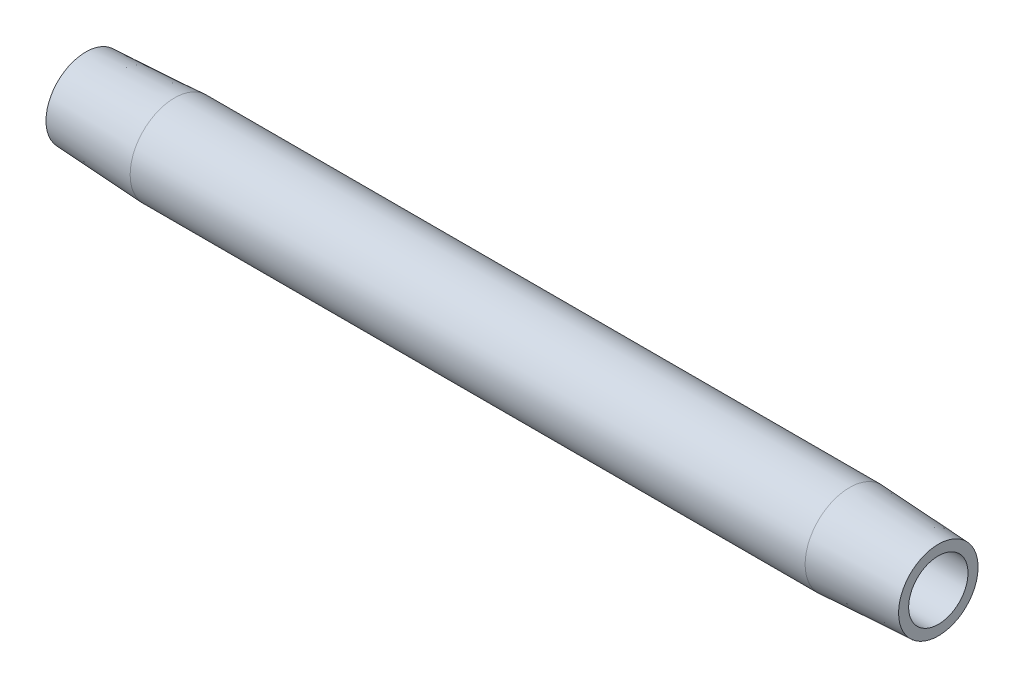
from build123d import *


with BuildPart() as part:
    # Sketch2 → Revolve1 (revolve)
    with BuildSketch(Plane.XY, mode=Mode.PRIVATE) as revolve1_sk:
        Polygon((7.9375, 3.96875), (0, 3.552763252), (0, 2.6543), (76.2, 2.6543), (76.2, 3.552763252), (68.2625, 3.96875), align=None)
    revolve(revolve1_sk.sketch.rotate(Axis((0.476141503, 0, 0), (1, 0, 0)), 90), axis=Axis((0.476141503, 0, 0), (1, 0, 0)))


solid = part.part
